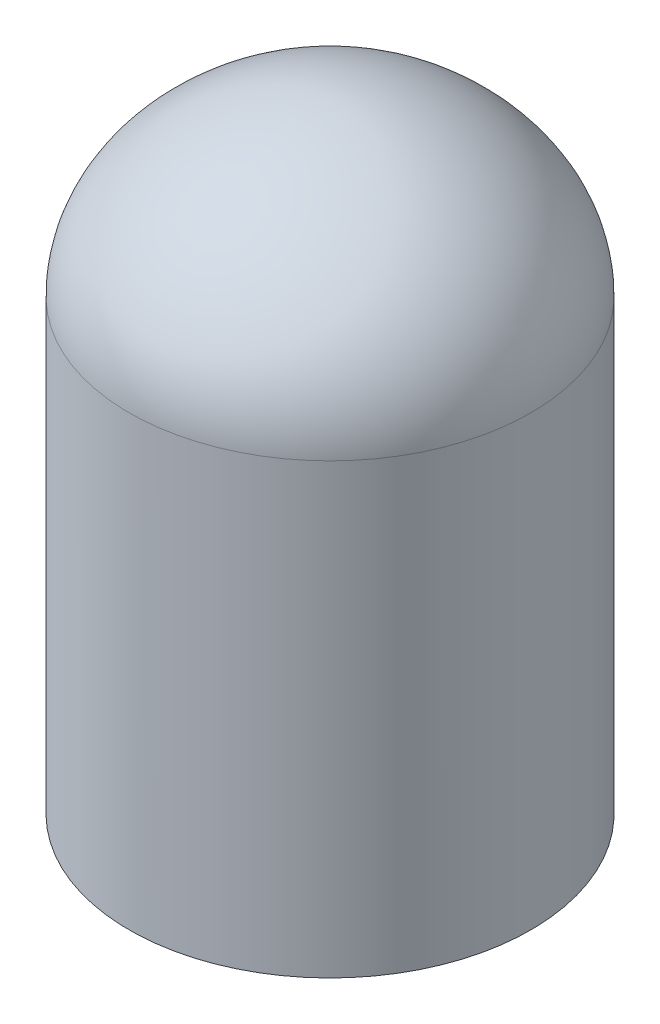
ISO-10303-21;
HEADER;
FILE_DESCRIPTION(('STEP AP214'),'2;1');
FILE_NAME('part.step','',(''),(''),'','','');
FILE_SCHEMA(('AUTOMOTIVE_DESIGN { 1 0 10303 214 1 1 1 1 }'));
ENDSEC;
DATA;
#1=APPLICATION_CONTEXT('core data for automotive mechanical design processes');
#2=APPLICATION_PROTOCOL_DEFINITION('international standard','automotive_design',2000,#1);
#3=PRODUCT_CONTEXT('',#1,'mechanical');
#4=PRODUCT('Part','Part','',(#3));
#5=PRODUCT_RELATED_PRODUCT_CATEGORY('part','',(#4));
#6=PRODUCT_DEFINITION_FORMATION('','',#4);
#7=PRODUCT_DEFINITION_CONTEXT('part definition',#1,'design');
#8=PRODUCT_DEFINITION('design','',#6,#7);
#9=PRODUCT_DEFINITION_SHAPE('','',#8);
#10=(LENGTH_UNIT() NAMED_UNIT(*) SI_UNIT(.MILLI.,.METRE.));
#11=(NAMED_UNIT(*) PLANE_ANGLE_UNIT() SI_UNIT($,.RADIAN.));
#12=(NAMED_UNIT(*) SI_UNIT($,.STERADIAN.) SOLID_ANGLE_UNIT());
#13=UNCERTAINTY_MEASURE_WITH_UNIT(LENGTH_MEASURE(1.E-05),#10,'distance_accuracy_value','');
#14=(GEOMETRIC_REPRESENTATION_CONTEXT(3) GLOBAL_UNCERTAINTY_ASSIGNED_CONTEXT((#13)) GLOBAL_UNIT_ASSIGNED_CONTEXT((#10,
#11,#12)) REPRESENTATION_CONTEXT('',''));
#15=CARTESIAN_POINT('',(0.,0.,0.));
#16=DIRECTION('',(0.,0.,1.));
#17=DIRECTION('',(1.,0.,0.));
#18=AXIS2_PLACEMENT_3D('',#15,#16,#17);
#19=CARTESIAN_POINT('',(7.62311967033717,78.614132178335,334.5));
#20=DIRECTION('',(0.,-1.,0.));
#21=DIRECTION('',(0.,0.,-1.));
#22=AXIS2_PLACEMENT_3D('',#19,#20,#21);
#23=CYLINDRICAL_SURFACE('',#22,19.5);
#24=CARTESIAN_POINT('',(7.62311967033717,30.1500305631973,334.5));
#25=DIRECTION('',(0.,-1.,0.));
#26=DIRECTION('',(0.,0.,-1.));
#27=AXIS2_PLACEMENT_3D('',#24,#25,#26);
#28=CIRCLE('',#27,19.5);
#29=CARTESIAN_POINT('',(7.62311967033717,30.1500305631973,315.));
#30=VERTEX_POINT('',#29);
#31=EDGE_CURVE('E13',#30,#30,#28,.T.);
#32=ORIENTED_EDGE('',*,*,#31,.F.);
#33=EDGE_LOOP('',(#32));
#34=FACE_BOUND('',#33,.T.);
#35=CARTESIAN_POINT('',(7.62311967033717,73.631742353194,334.5));
#36=DIRECTION('',(0.,-1.,0.));
#37=DIRECTION('',(0.,0.,-1.));
#38=AXIS2_PLACEMENT_3D('',#35,#36,#37);
#39=CIRCLE('',#38,19.5);
#40=CARTESIAN_POINT('',(7.62311967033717,73.631742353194,315.));
#41=VERTEX_POINT('',#40);
#42=EDGE_CURVE('E71',#41,#41,#39,.T.);
#43=ORIENTED_EDGE('',*,*,#42,.T.);
#44=EDGE_LOOP('',(#43));
#45=FACE_BOUND('',#44,.T.);
#46=ADVANCED_FACE('F47',(#34,#45),#23,.T.);
#47=CARTESIAN_POINT('',(-11.8768803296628,30.1500305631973,334.5));
#48=DIRECTION('',(0.,1.,0.));
#49=DIRECTION('',(0.,0.,1.));
#50=AXIS2_PLACEMENT_3D('',#47,#48,#49);
#51=PLANE('',#50);
#52=CARTESIAN_POINT('',(7.62311967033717,30.1500305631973,334.5));
#53=DIRECTION('',(0.,-1.,0.));
#54=DIRECTION('',(0.,0.,-1.));
#55=AXIS2_PLACEMENT_3D('',#52,#53,#54);
#56=CIRCLE('',#55,7.);
#57=CARTESIAN_POINT('',(7.62311967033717,30.1500305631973,327.5));
#58=VERTEX_POINT('',#57);
#59=EDGE_CURVE('E54',#58,#58,#56,.T.);
#60=ORIENTED_EDGE('',*,*,#59,.F.);
#61=EDGE_LOOP('',(#60));
#62=FACE_BOUND('',#61,.T.);
#63=ORIENTED_EDGE('',*,*,#31,.T.);
#64=EDGE_LOOP('',(#63));
#65=FACE_BOUND('',#64,.T.);
#66=ADVANCED_FACE('F83',(#62,#65),#51,.F.);
#67=CARTESIAN_POINT('',(7.62311967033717,78.614132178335,334.5));
#68=DIRECTION('',(0.,-1.,0.));
#69=DIRECTION('',(0.,0.,-1.));
#70=AXIS2_PLACEMENT_3D('',#67,#68,#69);
#71=CYLINDRICAL_SURFACE('',#70,7.);
#72=CARTESIAN_POINT('',(7.62311967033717,75.1500305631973,334.5));
#73=DIRECTION('',(0.,-1.,0.));
#74=DIRECTION('',(0.,0.,-1.));
#75=AXIS2_PLACEMENT_3D('',#72,#73,#74);
#76=CIRCLE('',#75,7.);
#77=CARTESIAN_POINT('',(7.62311967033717,75.1500305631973,327.5));
#78=VERTEX_POINT('',#77);
#79=EDGE_CURVE('E70',#78,#78,#76,.T.);
#80=ORIENTED_EDGE('',*,*,#79,.F.);
#81=EDGE_LOOP('',(#80));
#82=FACE_BOUND('',#81,.T.);
#83=ORIENTED_EDGE('',*,*,#59,.T.);
#84=EDGE_LOOP('',(#83));
#85=FACE_BOUND('',#84,.T.);
#86=ADVANCED_FACE('F81',(#82,#85),#71,.F.);
#87=CARTESIAN_POINT('',(0.623119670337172,75.1500305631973,334.5));
#88=DIRECTION('',(0.,1.,0.));
#89=DIRECTION('',(0.,0.,1.));
#90=AXIS2_PLACEMENT_3D('',#87,#88,#89);
#91=PLANE('',#90);
#92=CARTESIAN_POINT('',(7.62311967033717,75.1500305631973,334.5));
#93=DIRECTION('',(0.,-1.,0.));
#94=DIRECTION('',(0.,0.,-1.));
#95=AXIS2_PLACEMENT_3D('',#92,#93,#94);
#96=CIRCLE('',#95,6.);
#97=CARTESIAN_POINT('',(7.62311967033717,75.1500305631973,328.5));
#98=VERTEX_POINT('',#97);
#99=EDGE_CURVE('E68',#98,#98,#96,.T.);
#100=ORIENTED_EDGE('',*,*,#99,.F.);
#101=EDGE_LOOP('',(#100));
#102=FACE_BOUND('',#101,.T.);
#103=ORIENTED_EDGE('',*,*,#79,.T.);
#104=EDGE_LOOP('',(#103));
#105=FACE_BOUND('',#104,.T.);
#106=ADVANCED_FACE('F64',(#102,#105),#91,.F.);
#107=CARTESIAN_POINT('',(7.62311967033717,75.1500305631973,334.5));
#108=DIRECTION('',(0.,-1.,0.));
#109=DIRECTION('',(0.,0.,-1.));
#110=AXIS2_PLACEMENT_3D('',#107,#108,#109);
#111=CONICAL_SURFACE('',#110,6.,1.0471975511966);
#112=CARTESIAN_POINT('',(7.62311967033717,78.614132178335,334.5));
#113=VERTEX_POINT('',#112);
#114=VERTEX_LOOP('',#113);
#115=FACE_BOUND('',#114,.T.);
#116=ORIENTED_EDGE('',*,*,#99,.T.);
#117=EDGE_LOOP('',(#116));
#118=FACE_BOUND('',#117,.T.);
#119=ADVANCED_FACE('F60',(#115,#118),#111,.F.);
#120=CARTESIAN_POINT('',(7.62311967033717,90.1500305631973,334.5));
#121=CARTESIAN_POINT('',(-1.15578299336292,90.1500305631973,334.5));
#122=CARTESIAN_POINT('',(-11.8768803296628,83.2202883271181,334.5));
#123=CARTESIAN_POINT('',(-11.8768803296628,73.631742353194,334.5));
#124=B_SPLINE_CURVE_WITH_KNOTS('',3,(#120,#121,#122,#123),.UNSPECIFIED.,.F.,.F.,(4,4),(0.,1.),.UNSPECIFIED.);
#125=CARTESIAN_POINT('',(7.62311967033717,78.614132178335,334.5));
#126=DIRECTION('',(0.,-1.,0.));
#127=AXIS1_PLACEMENT('',#125,#126);
#128=SURFACE_OF_REVOLUTION('',#124,#127);
#129=ORIENTED_EDGE('',*,*,#42,.F.);
#130=EDGE_LOOP('',(#129));
#131=FACE_BOUND('',#130,.T.);
#132=CARTESIAN_POINT('',(7.62311967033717,90.1500305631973,334.5));
#133=VERTEX_POINT('',#132);
#134=VERTEX_LOOP('',#133);
#135=FACE_BOUND('',#134,.T.);
#136=ADVANCED_FACE('F63',(#131,#135),#128,.T.);
#137=CLOSED_SHELL('',(#46,#66,#86,#106,#119,#136));
#138=MANIFOLD_SOLID_BREP('B2',#137);
#139=ADVANCED_BREP_SHAPE_REPRESENTATION('',(#18,#138),#14);
#140=SHAPE_DEFINITION_REPRESENTATION(#9,#139);
ENDSEC;
END-ISO-10303-21;
